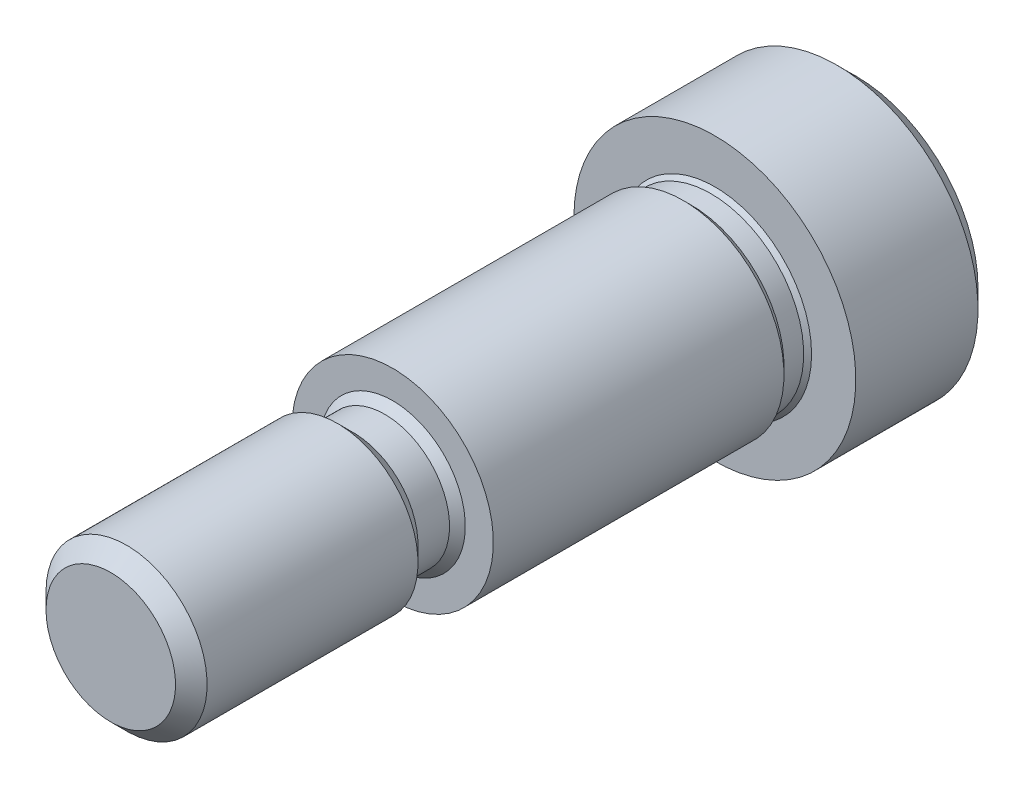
ISO-10303-21;
HEADER;
FILE_DESCRIPTION(('STEP AP214'),'2;1');
FILE_NAME('part.step','',(''),(''),'','','');
FILE_SCHEMA(('AUTOMOTIVE_DESIGN { 1 0 10303 214 1 1 1 1 }'));
ENDSEC;
DATA;
#1=APPLICATION_CONTEXT('core data for automotive mechanical design processes');
#2=APPLICATION_PROTOCOL_DEFINITION('international standard','automotive_design',2000,#1);
#3=PRODUCT_CONTEXT('',#1,'mechanical');
#4=PRODUCT('Part','Part','',(#3));
#5=PRODUCT_RELATED_PRODUCT_CATEGORY('part','',(#4));
#6=PRODUCT_DEFINITION_FORMATION('','',#4);
#7=PRODUCT_DEFINITION_CONTEXT('part definition',#1,'design');
#8=PRODUCT_DEFINITION('design','',#6,#7);
#9=PRODUCT_DEFINITION_SHAPE('','',#8);
#10=(LENGTH_UNIT() NAMED_UNIT(*) SI_UNIT(.MILLI.,.METRE.));
#11=(NAMED_UNIT(*) PLANE_ANGLE_UNIT() SI_UNIT($,.RADIAN.));
#12=(NAMED_UNIT(*) SI_UNIT($,.STERADIAN.) SOLID_ANGLE_UNIT());
#13=UNCERTAINTY_MEASURE_WITH_UNIT(LENGTH_MEASURE(1.E-05),#10,'distance_accuracy_value','');
#14=(GEOMETRIC_REPRESENTATION_CONTEXT(3) GLOBAL_UNCERTAINTY_ASSIGNED_CONTEXT((#13)) GLOBAL_UNIT_ASSIGNED_CONTEXT((#10,
#11,#12)) REPRESENTATION_CONTEXT('',''));
#15=CARTESIAN_POINT('',(0.,0.,0.));
#16=DIRECTION('',(0.,0.,1.));
#17=DIRECTION('',(1.,0.,0.));
#18=AXIS2_PLACEMENT_3D('',#15,#16,#17);
#19=CARTESIAN_POINT('',(0.,0.,-62.352722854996));
#20=DIRECTION('',(0.,0.,-1.));
#21=DIRECTION('',(-1.,0.,0.));
#22=AXIS2_PLACEMENT_3D('',#19,#20,#21);
#23=CYLINDRICAL_SURFACE('',#22,3.96875);
#24=CARTESIAN_POINT('',(0.,0.,-11.4554));
#25=DIRECTION('',(0.,0.,-1.));
#26=DIRECTION('',(-1.,0.,0.));
#27=AXIS2_PLACEMENT_3D('',#24,#25,#26);
#28=CIRCLE('',#27,3.96875);
#29=CARTESIAN_POINT('',(-3.96875000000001,0.,-11.4554));
#30=VERTEX_POINT('',#29);
#31=EDGE_CURVE('E164',#30,#30,#28,.T.);
#32=ORIENTED_EDGE('',*,*,#31,.F.);
#33=EDGE_LOOP('',(#32));
#34=FACE_BOUND('',#33,.T.);
#35=CARTESIAN_POINT('',(0.,0.,0.));
#36=DIRECTION('',(0.,0.,-1.));
#37=DIRECTION('',(-1.,0.,0.));
#38=AXIS2_PLACEMENT_3D('',#35,#36,#37);
#39=CIRCLE('',#38,3.96875);
#40=CARTESIAN_POINT('',(-3.96875000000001,0.,0.));
#41=VERTEX_POINT('',#40);
#42=EDGE_CURVE('E11',#41,#41,#39,.T.);
#43=ORIENTED_EDGE('',*,*,#42,.T.);
#44=EDGE_LOOP('',(#43));
#45=FACE_BOUND('',#44,.T.);
#46=ADVANCED_FACE('F49',(#34,#45),#23,.T.);
#47=CARTESIAN_POINT('',(-3.96875000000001,0.,0.));
#48=DIRECTION('',(0.,0.,-1.));
#49=DIRECTION('',(-1.,0.,0.));
#50=AXIS2_PLACEMENT_3D('',#47,#48,#49);
#51=PLANE('',#50);
#52=ORIENTED_EDGE('',*,*,#42,.F.);
#53=EDGE_LOOP('',(#52));
#54=FACE_BOUND('',#53,.T.);
#55=CARTESIAN_POINT('',(0.,0.,0.));
#56=DIRECTION('',(0.,0.,-1.));
#57=DIRECTION('',(-1.,0.,0.));
#58=AXIS2_PLACEMENT_3D('',#55,#56,#57);
#59=CIRCLE('',#58,2.86385);
#60=CARTESIAN_POINT('',(-2.86385000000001,0.,0.));
#61=VERTEX_POINT('',#60);
#62=EDGE_CURVE('E57',#61,#61,#59,.T.);
#63=ORIENTED_EDGE('',*,*,#62,.T.);
#64=EDGE_LOOP('',(#63));
#65=FACE_BOUND('',#64,.T.);
#66=ADVANCED_FACE('F225',(#54,#65),#51,.F.);
#67=CARTESIAN_POINT('',(0.,0.,0.311149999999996));
#68=DIRECTION('',(0.,0.,-1.));
#69=DIRECTION('',(-1.,0.,0.));
#70=AXIS2_PLACEMENT_3D('',#67,#68,#69);
#71=CONICAL_SURFACE('',#70,2.5527,0.785398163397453);
#72=ORIENTED_EDGE('',*,*,#62,.F.);
#73=EDGE_LOOP('',(#72));
#74=FACE_BOUND('',#73,.T.);
#75=CARTESIAN_POINT('',(0.,0.,0.311149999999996));
#76=DIRECTION('',(0.,0.,-1.));
#77=DIRECTION('',(-1.,0.,0.));
#78=AXIS2_PLACEMENT_3D('',#75,#76,#77);
#79=CIRCLE('',#78,2.5527);
#80=CARTESIAN_POINT('',(-2.55270000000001,0.,0.311149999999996));
#81=VERTEX_POINT('',#80);
#82=EDGE_CURVE('E217',#81,#81,#79,.T.);
#83=ORIENTED_EDGE('',*,*,#82,.T.);
#84=EDGE_LOOP('',(#83));
#85=FACE_BOUND('',#84,.T.);
#86=ADVANCED_FACE('F227',(#74,#85),#71,.T.);
#87=CARTESIAN_POINT('',(0.,0.,-62.352722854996));
#88=DIRECTION('',(0.,0.,-1.));
#89=DIRECTION('',(-1.,0.,0.));
#90=AXIS2_PLACEMENT_3D('',#87,#88,#89);
#91=CYLINDRICAL_SURFACE('',#90,2.5527);
#92=ORIENTED_EDGE('',*,*,#82,.F.);
#93=EDGE_LOOP('',(#92));
#94=FACE_BOUND('',#93,.T.);
#95=CARTESIAN_POINT('',(0.,0.,1.55574999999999));
#96=DIRECTION('',(0.,0.,-1.));
#97=DIRECTION('',(-1.,0.,0.));
#98=AXIS2_PLACEMENT_3D('',#95,#96,#97);
#99=CIRCLE('',#98,2.5527);
#100=CARTESIAN_POINT('',(-2.55270000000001,0.,1.55574999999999));
#101=VERTEX_POINT('',#100);
#102=EDGE_CURVE('E213',#101,#101,#99,.T.);
#103=ORIENTED_EDGE('',*,*,#102,.T.);
#104=EDGE_LOOP('',(#103));
#105=FACE_BOUND('',#104,.T.);
#106=ADVANCED_FACE('F230',(#94,#105),#91,.T.);
#107=CARTESIAN_POINT('',(0.,0.,2.17805));
#108=DIRECTION('',(0.,0.,1.));
#109=DIRECTION('',(1.,0.,0.));
#110=AXIS2_PLACEMENT_3D('',#107,#108,#109);
#111=CONICAL_SURFACE('',#110,3.175,0.785398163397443);
#112=ORIENTED_EDGE('',*,*,#102,.F.);
#113=EDGE_LOOP('',(#112));
#114=FACE_BOUND('',#113,.T.);
#115=CARTESIAN_POINT('',(0.,0.,2.17805));
#116=DIRECTION('',(0.,0.,-1.));
#117=DIRECTION('',(-1.,0.,0.));
#118=AXIS2_PLACEMENT_3D('',#115,#116,#117);
#119=CIRCLE('',#118,3.175);
#120=CARTESIAN_POINT('',(-3.17500000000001,0.,2.17805));
#121=VERTEX_POINT('',#120);
#122=EDGE_CURVE('E209',#121,#121,#119,.T.);
#123=ORIENTED_EDGE('',*,*,#122,.T.);
#124=EDGE_LOOP('',(#123));
#125=FACE_BOUND('',#124,.T.);
#126=ADVANCED_FACE('F236',(#114,#125),#111,.T.);
#127=CARTESIAN_POINT('',(0.,0.,-62.352722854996));
#128=DIRECTION('',(0.,0.,-1.));
#129=DIRECTION('',(-1.,0.,0.));
#130=AXIS2_PLACEMENT_3D('',#127,#128,#129);
#131=CYLINDRICAL_SURFACE('',#130,3.175);
#132=ORIENTED_EDGE('',*,*,#122,.F.);
#133=EDGE_LOOP('',(#132));
#134=FACE_BOUND('',#133,.T.);
#135=CARTESIAN_POINT('',(0.,0.,10.4902));
#136=DIRECTION('',(0.,0.,-1.));
#137=DIRECTION('',(-1.,0.,0.));
#138=AXIS2_PLACEMENT_3D('',#135,#136,#137);
#139=CIRCLE('',#138,3.175);
#140=CARTESIAN_POINT('',(-3.17500000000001,0.,10.4902));
#141=VERTEX_POINT('',#140);
#142=EDGE_CURVE('E205',#141,#141,#139,.T.);
#143=ORIENTED_EDGE('',*,*,#142,.T.);
#144=EDGE_LOOP('',(#143));
#145=FACE_BOUND('',#144,.T.);
#146=ADVANCED_FACE('F242',(#134,#145),#131,.T.);
#147=CARTESIAN_POINT('',(0.,0.,11.1125));
#148=DIRECTION('',(0.,0.,-1.));
#149=DIRECTION('',(-1.,0.,0.));
#150=AXIS2_PLACEMENT_3D('',#147,#148,#149);
#151=CONICAL_SURFACE('',#150,2.5527,0.785398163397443);
#152=ORIENTED_EDGE('',*,*,#142,.F.);
#153=EDGE_LOOP('',(#152));
#154=FACE_BOUND('',#153,.T.);
#155=CARTESIAN_POINT('',(0.,0.,11.1125));
#156=DIRECTION('',(0.,0.,-1.));
#157=DIRECTION('',(-1.,0.,0.));
#158=AXIS2_PLACEMENT_3D('',#155,#156,#157);
#159=CIRCLE('',#158,2.5527);
#160=CARTESIAN_POINT('',(-2.55270000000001,0.,11.1125));
#161=VERTEX_POINT('',#160);
#162=EDGE_CURVE('E201',#161,#161,#159,.T.);
#163=ORIENTED_EDGE('',*,*,#162,.T.);
#164=EDGE_LOOP('',(#163));
#165=FACE_BOUND('',#164,.T.);
#166=ADVANCED_FACE('F248',(#154,#165),#151,.T.);
#167=CARTESIAN_POINT('',(-2.55270000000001,0.,11.1125));
#168=DIRECTION('',(0.,0.,-1.));
#169=DIRECTION('',(-1.,0.,0.));
#170=AXIS2_PLACEMENT_3D('',#167,#168,#169);
#171=PLANE('',#170);
#172=ORIENTED_EDGE('',*,*,#162,.F.);
#173=EDGE_LOOP('',(#172));
#174=FACE_BOUND('',#173,.T.);
#175=ADVANCED_FACE('F254',(#174),#171,.F.);
#176=CARTESIAN_POINT('',(-4.81541666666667,0.,-18.25752));
#177=DIRECTION('',(0.,0.,1.));
#178=DIRECTION('',(1.,0.,0.));
#179=AXIS2_PLACEMENT_3D('',#176,#177,#178);
#180=PLANE('',#179);
#181=DIRECTION('',(-0.5,-0.866025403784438,0.));
#182=VECTOR('',#181,1.);
#183=CARTESIAN_POINT('',(2.2920921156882,0.,-18.25752));
#184=LINE('',#183,#182);
#185=CARTESIAN_POINT('',(2.2920921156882,0.,-18.25752));
#186=VERTEX_POINT('',#185);
#187=CARTESIAN_POINT('',(1.1460460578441,-1.98501,-18.25752));
#188=VERTEX_POINT('',#187);
#189=EDGE_CURVE('E145',#186,#188,#184,.T.);
#190=ORIENTED_EDGE('',*,*,#189,.F.);
#191=DIRECTION('',(0.499999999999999,-0.866025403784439,0.));
#192=VECTOR('',#191,1.);
#193=CARTESIAN_POINT('',(1.1460460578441,1.98501,-18.25752));
#194=LINE('',#193,#192);
#195=CARTESIAN_POINT('',(1.1460460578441,1.98501,-18.25752));
#196=VERTEX_POINT('',#195);
#197=EDGE_CURVE('E64',#196,#186,#194,.T.);
#198=ORIENTED_EDGE('',*,*,#197,.F.);
#199=DIRECTION('',(1.,0.,0.));
#200=VECTOR('',#199,1.);
#201=CARTESIAN_POINT('',(-1.1460460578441,1.98501,-18.25752));
#202=LINE('',#201,#200);
#203=CARTESIAN_POINT('',(-1.1460460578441,1.98501,-18.25752));
#204=VERTEX_POINT('',#203);
#205=EDGE_CURVE('E158',#204,#196,#202,.T.);
#206=ORIENTED_EDGE('',*,*,#205,.F.);
#207=DIRECTION('',(0.5,0.866025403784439,0.));
#208=VECTOR('',#207,1.);
#209=CARTESIAN_POINT('',(-2.2920921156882,0.,-18.25752));
#210=LINE('',#209,#208);
#211=CARTESIAN_POINT('',(-2.2920921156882,0.,-18.25752));
#212=VERTEX_POINT('',#211);
#213=EDGE_CURVE('E155',#212,#204,#210,.T.);
#214=ORIENTED_EDGE('',*,*,#213,.F.);
#215=DIRECTION('',(-0.5,0.866025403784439,0.));
#216=VECTOR('',#215,1.);
#217=CARTESIAN_POINT('',(-1.1460460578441,-1.98501,-18.25752));
#218=LINE('',#217,#216);
#219=CARTESIAN_POINT('',(-1.1460460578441,-1.98501,-18.25752));
#220=VERTEX_POINT('',#219);
#221=EDGE_CURVE('E112',#220,#212,#218,.T.);
#222=ORIENTED_EDGE('',*,*,#221,.F.);
#223=DIRECTION('',(-1.,0.,0.));
#224=VECTOR('',#223,1.);
#225=CARTESIAN_POINT('',(1.1460460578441,-1.98501,-18.25752));
#226=LINE('',#225,#224);
#227=EDGE_CURVE('E149',#188,#220,#226,.T.);
#228=ORIENTED_EDGE('',*,*,#227,.F.);
#229=EDGE_LOOP('',(#190,#198,#206,#214,#222,#228));
#230=FACE_BOUND('',#229,.T.);
#231=CARTESIAN_POINT('',(0.,0.,-18.25752));
#232=DIRECTION('',(0.,0.,-1.));
#233=DIRECTION('',(-1.,0.,0.));
#234=AXIS2_PLACEMENT_3D('',#231,#232,#233);
#235=CIRCLE('',#234,4.81541666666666);
#236=CARTESIAN_POINT('',(-4.81541666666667,0.,-18.25752));
#237=VERTEX_POINT('',#236);
#238=EDGE_CURVE('E197',#237,#237,#235,.T.);
#239=ORIENTED_EDGE('',*,*,#238,.T.);
#240=EDGE_LOOP('',(#239));
#241=FACE_BOUND('',#240,.T.);
#242=ADVANCED_FACE('F259',(#230,#241),#180,.F.);
#243=CARTESIAN_POINT('',(0.,0.,-17.5166866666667));
#244=DIRECTION('',(0.,0.,1.));
#245=DIRECTION('',(1.,0.,0.));
#246=AXIS2_PLACEMENT_3D('',#243,#244,#245);
#247=CONICAL_SURFACE('',#246,5.55625,0.785398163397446);
#248=ORIENTED_EDGE('',*,*,#238,.F.);
#249=EDGE_LOOP('',(#248));
#250=FACE_BOUND('',#249,.T.);
#251=CARTESIAN_POINT('',(0.,0.,-17.5166866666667));
#252=DIRECTION('',(0.,0.,-1.));
#253=DIRECTION('',(-1.,0.,0.));
#254=AXIS2_PLACEMENT_3D('',#251,#252,#253);
#255=CIRCLE('',#254,5.55625);
#256=CARTESIAN_POINT('',(-5.55625,0.,-17.5166866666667));
#257=VERTEX_POINT('',#256);
#258=EDGE_CURVE('E193',#257,#257,#255,.T.);
#259=ORIENTED_EDGE('',*,*,#258,.T.);
#260=EDGE_LOOP('',(#259));
#261=FACE_BOUND('',#260,.T.);
#262=ADVANCED_FACE('F266',(#250,#261),#247,.T.);
#263=CARTESIAN_POINT('',(0.,0.,-62.352722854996));
#264=DIRECTION('',(0.,0.,-1.));
#265=DIRECTION('',(-1.,0.,0.));
#266=AXIS2_PLACEMENT_3D('',#263,#264,#265);
#267=CYLINDRICAL_SURFACE('',#266,5.55625);
#268=ORIENTED_EDGE('',*,*,#258,.F.);
#269=EDGE_LOOP('',(#268));
#270=FACE_BOUND('',#269,.T.);
#271=CARTESIAN_POINT('',(0.,0.,-12.7));
#272=DIRECTION('',(0.,0.,-1.));
#273=DIRECTION('',(-1.,0.,0.));
#274=AXIS2_PLACEMENT_3D('',#271,#272,#273);
#275=CIRCLE('',#274,5.55625);
#276=CARTESIAN_POINT('',(-5.55625,0.,-12.7));
#277=VERTEX_POINT('',#276);
#278=EDGE_CURVE('E189',#277,#277,#275,.T.);
#279=ORIENTED_EDGE('',*,*,#278,.T.);
#280=EDGE_LOOP('',(#279));
#281=FACE_BOUND('',#280,.T.);
#282=ADVANCED_FACE('F303',(#270,#281),#267,.T.);
#283=CARTESIAN_POINT('',(-3.81317500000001,0.,-12.7));
#284=DIRECTION('',(0.,0.,-1.));
#285=DIRECTION('',(-1.,0.,0.));
#286=AXIS2_PLACEMENT_3D('',#283,#284,#285);
#287=PLANE('',#286);
#288=ORIENTED_EDGE('',*,*,#278,.F.);
#289=EDGE_LOOP('',(#288));
#290=FACE_BOUND('',#289,.T.);
#291=CARTESIAN_POINT('',(0.,0.,-12.7));
#292=DIRECTION('',(0.,0.,-1.));
#293=DIRECTION('',(-1.,0.,0.));
#294=AXIS2_PLACEMENT_3D('',#291,#292,#293);
#295=CIRCLE('',#294,3.813175);
#296=CARTESIAN_POINT('',(-3.81317500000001,0.,-12.7));
#297=VERTEX_POINT('',#296);
#298=EDGE_CURVE('E185',#297,#297,#295,.T.);
#299=ORIENTED_EDGE('',*,*,#298,.T.);
#300=EDGE_LOOP('',(#299));
#301=FACE_BOUND('',#300,.T.);
#302=ADVANCED_FACE('F299',(#290,#301),#287,.F.);
#303=CARTESIAN_POINT('',(0.,0.,-12.544425));
#304=DIRECTION('',(0.,0.,-1.));
#305=DIRECTION('',(-1.,0.,0.));
#306=AXIS2_PLACEMENT_3D('',#303,#304,#305);
#307=CONICAL_SURFACE('',#306,3.6576,0.785398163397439);
#308=ORIENTED_EDGE('',*,*,#298,.F.);
#309=EDGE_LOOP('',(#308));
#310=FACE_BOUND('',#309,.T.);
#311=CARTESIAN_POINT('',(0.,0.,-12.544425));
#312=DIRECTION('',(0.,0.,-1.));
#313=DIRECTION('',(-1.,0.,0.));
#314=AXIS2_PLACEMENT_3D('',#311,#312,#313);
#315=CIRCLE('',#314,3.6576);
#316=CARTESIAN_POINT('',(-3.65760000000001,0.,-12.544425));
#317=VERTEX_POINT('',#316);
#318=EDGE_CURVE('E181',#317,#317,#315,.T.);
#319=ORIENTED_EDGE('',*,*,#318,.T.);
#320=EDGE_LOOP('',(#319));
#321=FACE_BOUND('',#320,.T.);
#322=ADVANCED_FACE('F291',(#310,#321),#307,.T.);
#323=CARTESIAN_POINT('',(0.,0.,-62.352722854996));
#324=DIRECTION('',(0.,0.,-1.));
#325=DIRECTION('',(-1.,0.,0.));
#326=AXIS2_PLACEMENT_3D('',#323,#324,#325);
#327=CYLINDRICAL_SURFACE('',#326,3.6576);
#328=ORIENTED_EDGE('',*,*,#318,.F.);
#329=EDGE_LOOP('',(#328));
#330=FACE_BOUND('',#329,.T.);
#331=CARTESIAN_POINT('',(0.,0.,-11.76655));
#332=DIRECTION('',(0.,0.,-1.));
#333=DIRECTION('',(-1.,0.,0.));
#334=AXIS2_PLACEMENT_3D('',#331,#332,#333);
#335=CIRCLE('',#334,3.6576);
#336=CARTESIAN_POINT('',(-3.65760000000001,0.,-11.76655));
#337=VERTEX_POINT('',#336);
#338=EDGE_CURVE('E177',#337,#337,#335,.T.);
#339=ORIENTED_EDGE('',*,*,#338,.T.);
#340=EDGE_LOOP('',(#339));
#341=FACE_BOUND('',#340,.T.);
#342=ADVANCED_FACE('F282',(#330,#341),#327,.T.);
#343=CARTESIAN_POINT('',(0.,0.,-11.4554));
#344=DIRECTION('',(0.,0.,1.));
#345=DIRECTION('',(1.,0.,0.));
#346=AXIS2_PLACEMENT_3D('',#343,#344,#345);
#347=CONICAL_SURFACE('',#346,3.96875,0.785398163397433);
#348=ORIENTED_EDGE('',*,*,#338,.F.);
#349=EDGE_LOOP('',(#348));
#350=FACE_BOUND('',#349,.T.);
#351=ORIENTED_EDGE('',*,*,#31,.T.);
#352=EDGE_LOOP('',(#351));
#353=FACE_BOUND('',#352,.T.);
#354=ADVANCED_FACE('F279',(#350,#353),#347,.T.);
#355=CARTESIAN_POINT('',(1.1460460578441,1.98501,-14.5525066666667));
#356=DIRECTION('',(0.866025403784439,0.5,0.));
#357=DIRECTION('',(-0.5,0.866025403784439,0.));
#358=AXIS2_PLACEMENT_3D('',#355,#356,#357);
#359=PLANE('',#358);
#360=ORIENTED_EDGE('',*,*,#197,.T.);
#361=DIRECTION('',(0.,0.,-1.));
#362=VECTOR('',#361,1.);
#363=CARTESIAN_POINT('',(2.2920921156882,0.,-14.5525066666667));
#364=LINE('',#363,#362);
#365=CARTESIAN_POINT('',(2.2920921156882,0.,-14.5525066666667));
#366=VERTEX_POINT('',#365);
#367=EDGE_CURVE('E94',#366,#186,#364,.T.);
#368=ORIENTED_EDGE('',*,*,#367,.F.);
#369=DIRECTION('',(0.499999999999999,-0.866025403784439,0.));
#370=VECTOR('',#369,1.);
#371=CARTESIAN_POINT('',(1.1460460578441,1.98501,-14.5525066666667));
#372=LINE('',#371,#370);
#373=CARTESIAN_POINT('',(1.1460460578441,1.98501,-14.5525066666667));
#374=VERTEX_POINT('',#373);
#375=EDGE_CURVE('E161',#374,#366,#372,.T.);
#376=ORIENTED_EDGE('',*,*,#375,.F.);
#377=DIRECTION('',(0.,0.,-1.));
#378=VECTOR('',#377,1.);
#379=CARTESIAN_POINT('',(1.1460460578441,1.98501,-14.5525066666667));
#380=LINE('',#379,#378);
#381=EDGE_CURVE('E72',#374,#196,#380,.T.);
#382=ORIENTED_EDGE('',*,*,#381,.T.);
#383=EDGE_LOOP('',(#360,#368,#376,#382));
#384=FACE_BOUND('',#383,.T.);
#385=ADVANCED_FACE('F281',(#384),#359,.F.);
#386=CARTESIAN_POINT('',(-1.1460460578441,1.98501,-14.5525066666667));
#387=DIRECTION('',(0.,1.,0.));
#388=DIRECTION('',(-1.,0.,0.));
#389=AXIS2_PLACEMENT_3D('',#386,#387,#388);
#390=PLANE('',#389);
#391=ORIENTED_EDGE('',*,*,#205,.T.);
#392=ORIENTED_EDGE('',*,*,#381,.F.);
#393=DIRECTION('',(1.,0.,0.));
#394=VECTOR('',#393,1.);
#395=CARTESIAN_POINT('',(-1.1460460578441,1.98501,-14.5525066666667));
#396=LINE('',#395,#394);
#397=CARTESIAN_POINT('',(-1.1460460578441,1.98501,-14.5525066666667));
#398=VERTEX_POINT('',#397);
#399=EDGE_CURVE('E126',#398,#374,#396,.T.);
#400=ORIENTED_EDGE('',*,*,#399,.F.);
#401=DIRECTION('',(0.,0.,-1.));
#402=VECTOR('',#401,1.);
#403=CARTESIAN_POINT('',(-1.1460460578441,1.98501,-14.5525066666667));
#404=LINE('',#403,#402);
#405=EDGE_CURVE('E117',#398,#204,#404,.T.);
#406=ORIENTED_EDGE('',*,*,#405,.T.);
#407=EDGE_LOOP('',(#391,#392,#400,#406));
#408=FACE_BOUND('',#407,.T.);
#409=ADVANCED_FACE('F289',(#408),#390,.F.);
#410=CARTESIAN_POINT('',(-2.2920921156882,0.,-14.5525066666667));
#411=DIRECTION('',(-0.866025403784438,0.5,0.));
#412=DIRECTION('',(-0.5,-0.866025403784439,0.));
#413=AXIS2_PLACEMENT_3D('',#410,#411,#412);
#414=PLANE('',#413);
#415=ORIENTED_EDGE('',*,*,#213,.T.);
#416=ORIENTED_EDGE('',*,*,#405,.F.);
#417=DIRECTION('',(0.5,0.866025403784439,0.));
#418=VECTOR('',#417,1.);
#419=CARTESIAN_POINT('',(-2.2920921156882,0.,-14.5525066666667));
#420=LINE('',#419,#418);
#421=CARTESIAN_POINT('',(-2.2920921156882,0.,-14.5525066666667));
#422=VERTEX_POINT('',#421);
#423=EDGE_CURVE('E121',#422,#398,#420,.T.);
#424=ORIENTED_EDGE('',*,*,#423,.F.);
#425=DIRECTION('',(0.,0.,-1.));
#426=VECTOR('',#425,1.);
#427=CARTESIAN_POINT('',(-2.2920921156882,0.,-14.5525066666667));
#428=LINE('',#427,#426);
#429=EDGE_CURVE('E105',#422,#212,#428,.T.);
#430=ORIENTED_EDGE('',*,*,#429,.T.);
#431=EDGE_LOOP('',(#415,#416,#424,#430));
#432=FACE_BOUND('',#431,.T.);
#433=ADVANCED_FACE('F122',(#432),#414,.F.);
#434=CARTESIAN_POINT('',(-1.1460460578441,-1.98501,-14.5525066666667));
#435=DIRECTION('',(-0.866025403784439,-0.5,0.));
#436=DIRECTION('',(0.5,-0.866025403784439,0.));
#437=AXIS2_PLACEMENT_3D('',#434,#435,#436);
#438=PLANE('',#437);
#439=ORIENTED_EDGE('',*,*,#221,.T.);
#440=ORIENTED_EDGE('',*,*,#429,.F.);
#441=DIRECTION('',(-0.5,0.866025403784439,0.));
#442=VECTOR('',#441,1.);
#443=CARTESIAN_POINT('',(-1.1460460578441,-1.98501,-14.5525066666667));
#444=LINE('',#443,#442);
#445=CARTESIAN_POINT('',(-1.1460460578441,-1.98501,-14.5525066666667));
#446=VERTEX_POINT('',#445);
#447=EDGE_CURVE('E109',#446,#422,#444,.T.);
#448=ORIENTED_EDGE('',*,*,#447,.F.);
#449=DIRECTION('',(0.,0.,-1.));
#450=VECTOR('',#449,1.);
#451=CARTESIAN_POINT('',(-1.1460460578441,-1.98501,-14.5525066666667));
#452=LINE('',#451,#450);
#453=EDGE_CURVE('E118',#446,#220,#452,.T.);
#454=ORIENTED_EDGE('',*,*,#453,.T.);
#455=EDGE_LOOP('',(#439,#440,#448,#454));
#456=FACE_BOUND('',#455,.T.);
#457=ADVANCED_FACE('F107',(#456),#438,.F.);
#458=CARTESIAN_POINT('',(1.1460460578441,-1.98501,-14.5525066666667));
#459=DIRECTION('',(0.,-1.,0.));
#460=DIRECTION('',(1.,0.,0.));
#461=AXIS2_PLACEMENT_3D('',#458,#459,#460);
#462=PLANE('',#461);
#463=ORIENTED_EDGE('',*,*,#227,.T.);
#464=ORIENTED_EDGE('',*,*,#453,.F.);
#465=DIRECTION('',(-1.,0.,0.));
#466=VECTOR('',#465,1.);
#467=CARTESIAN_POINT('',(1.1460460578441,-1.98501,-14.5525066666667));
#468=LINE('',#467,#466);
#469=CARTESIAN_POINT('',(1.1460460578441,-1.98501,-14.5525066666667));
#470=VERTEX_POINT('',#469);
#471=EDGE_CURVE('E132',#470,#446,#468,.T.);
#472=ORIENTED_EDGE('',*,*,#471,.F.);
#473=DIRECTION('',(0.,0.,-1.));
#474=VECTOR('',#473,1.);
#475=CARTESIAN_POINT('',(1.1460460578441,-1.98501,-14.5525066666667));
#476=LINE('',#475,#474);
#477=EDGE_CURVE('E169',#470,#188,#476,.T.);
#478=ORIENTED_EDGE('',*,*,#477,.T.);
#479=EDGE_LOOP('',(#463,#464,#472,#478));
#480=FACE_BOUND('',#479,.T.);
#481=ADVANCED_FACE('F386',(#480),#462,.F.);
#482=CARTESIAN_POINT('',(2.2920921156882,0.,-14.5525066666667));
#483=DIRECTION('',(0.866025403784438,-0.5,0.));
#484=DIRECTION('',(0.5,0.866025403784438,0.));
#485=AXIS2_PLACEMENT_3D('',#482,#483,#484);
#486=PLANE('',#485);
#487=ORIENTED_EDGE('',*,*,#189,.T.);
#488=ORIENTED_EDGE('',*,*,#477,.F.);
#489=DIRECTION('',(-0.5,-0.866025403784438,0.));
#490=VECTOR('',#489,1.);
#491=CARTESIAN_POINT('',(2.2920921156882,0.,-14.5525066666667));
#492=LINE('',#491,#490);
#493=EDGE_CURVE('E137',#366,#470,#492,.T.);
#494=ORIENTED_EDGE('',*,*,#493,.F.);
#495=ORIENTED_EDGE('',*,*,#367,.T.);
#496=EDGE_LOOP('',(#487,#488,#494,#495));
#497=FACE_BOUND('',#496,.T.);
#498=ADVANCED_FACE('F397',(#497),#486,.F.);
#499=CARTESIAN_POINT('',(1.1460460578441,1.98501,-14.5525066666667));
#500=DIRECTION('',(0.,0.,1.));
#501=DIRECTION('',(1.,0.,0.));
#502=AXIS2_PLACEMENT_3D('',#499,#500,#501);
#503=PLANE('',#502);
#504=ORIENTED_EDGE('',*,*,#375,.T.);
#505=ORIENTED_EDGE('',*,*,#493,.T.);
#506=ORIENTED_EDGE('',*,*,#471,.T.);
#507=ORIENTED_EDGE('',*,*,#447,.T.);
#508=ORIENTED_EDGE('',*,*,#423,.T.);
#509=ORIENTED_EDGE('',*,*,#399,.T.);
#510=EDGE_LOOP('',(#504,#505,#506,#507,#508,#509));
#511=FACE_BOUND('',#510,.T.);
#512=ADVANCED_FACE('F129',(#511),#503,.F.);
#513=CLOSED_SHELL('',(#46,#66,#86,#106,#126,#146,#166,#175,#242,#262,#282,#302,#322,#342,#354,
#385,#409,#433,#457,#481,#498,#512));
#514=MANIFOLD_SOLID_BREP('B2',#513);
#515=ADVANCED_BREP_SHAPE_REPRESENTATION('',(#18,#514),#14);
#516=SHAPE_DEFINITION_REPRESENTATION(#9,#515);
ENDSEC;
END-ISO-10303-21;
